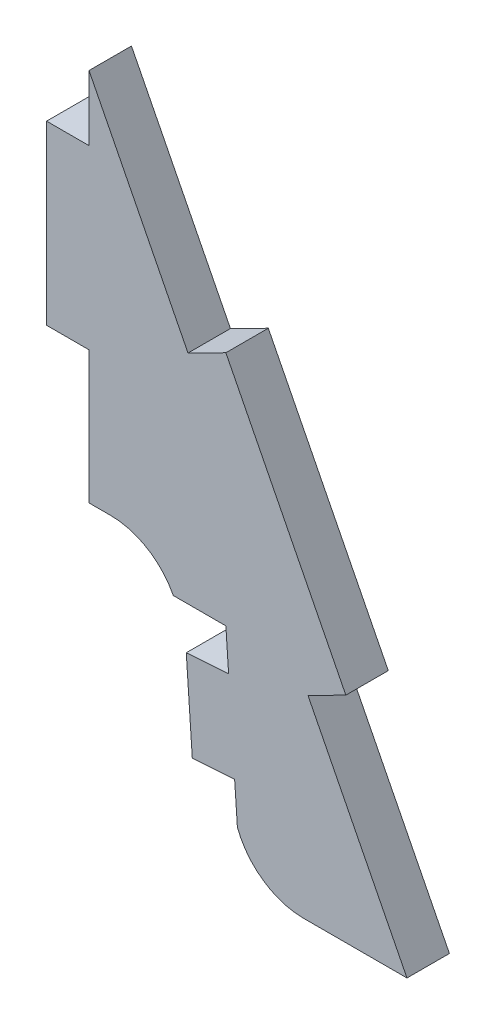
ISO-10303-21;
HEADER;
FILE_DESCRIPTION(('STEP AP214'),'2;1');
FILE_NAME('part.step','',(''),(''),'','','');
FILE_SCHEMA(('AUTOMOTIVE_DESIGN { 1 0 10303 214 1 1 1 1 }'));
ENDSEC;
DATA;
#1=APPLICATION_CONTEXT('core data for automotive mechanical design processes');
#2=APPLICATION_PROTOCOL_DEFINITION('international standard','automotive_design',2000,#1);
#3=PRODUCT_CONTEXT('',#1,'mechanical');
#4=PRODUCT('Part','Part','',(#3));
#5=PRODUCT_RELATED_PRODUCT_CATEGORY('part','',(#4));
#6=PRODUCT_DEFINITION_FORMATION('','',#4);
#7=PRODUCT_DEFINITION_CONTEXT('part definition',#1,'design');
#8=PRODUCT_DEFINITION('design','',#6,#7);
#9=PRODUCT_DEFINITION_SHAPE('','',#8);
#10=(LENGTH_UNIT() NAMED_UNIT(*) SI_UNIT(.MILLI.,.METRE.));
#11=(NAMED_UNIT(*) PLANE_ANGLE_UNIT() SI_UNIT($,.RADIAN.));
#12=(NAMED_UNIT(*) SI_UNIT($,.STERADIAN.) SOLID_ANGLE_UNIT());
#13=UNCERTAINTY_MEASURE_WITH_UNIT(LENGTH_MEASURE(1.E-05),#10,'distance_accuracy_value','');
#14=(GEOMETRIC_REPRESENTATION_CONTEXT(3) GLOBAL_UNCERTAINTY_ASSIGNED_CONTEXT((#13)) GLOBAL_UNIT_ASSIGNED_CONTEXT((#10,
#11,#12)) REPRESENTATION_CONTEXT('',''));
#15=CARTESIAN_POINT('',(0.,0.,0.));
#16=DIRECTION('',(0.,0.,1.));
#17=DIRECTION('',(1.,0.,0.));
#18=AXIS2_PLACEMENT_3D('',#15,#16,#17);
#19=CARTESIAN_POINT('',(1.52399999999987,-268.631646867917,1.524));
#20=DIRECTION('',(1.,0.,0.));
#21=DIRECTION('',(0.,1.,0.));
#22=AXIS2_PLACEMENT_3D('',#19,#20,#21);
#23=PLANE('',#22);
#24=DIRECTION('',(0.,-1.,0.));
#25=VECTOR('',#24,1.);
#26=CARTESIAN_POINT('',(1.52399999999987,-268.631646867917,0.));
#27=LINE('',#26,#25);
#28=CARTESIAN_POINT('',(1.52399999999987,-263.869146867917,0.));
#29=VERTEX_POINT('',#28);
#30=CARTESIAN_POINT('',(1.52399999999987,-268.631646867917,0.));
#31=VERTEX_POINT('',#30);
#32=EDGE_CURVE('E202',#29,#31,#27,.T.);
#33=ORIENTED_EDGE('',*,*,#32,.T.);
#34=DIRECTION('',(0.,0.,-1.));
#35=VECTOR('',#34,1.);
#36=CARTESIAN_POINT('',(1.52399999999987,-268.631646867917,1.524));
#37=LINE('',#36,#35);
#38=CARTESIAN_POINT('',(1.52399999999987,-268.631646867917,1.524));
#39=VERTEX_POINT('',#38);
#40=EDGE_CURVE('E11',#39,#31,#37,.T.);
#41=ORIENTED_EDGE('',*,*,#40,.F.);
#42=DIRECTION('',(0.,-1.,0.));
#43=VECTOR('',#42,1.);
#44=CARTESIAN_POINT('',(1.52399999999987,-268.631646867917,1.524));
#45=LINE('',#44,#43);
#46=CARTESIAN_POINT('',(1.52399999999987,-263.869146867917,1.524));
#47=VERTEX_POINT('',#46);
#48=EDGE_CURVE('E240',#47,#39,#45,.T.);
#49=ORIENTED_EDGE('',*,*,#48,.F.);
#50=DIRECTION('',(0.,0.,-1.));
#51=VECTOR('',#50,1.);
#52=CARTESIAN_POINT('',(1.52399999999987,-263.869146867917,1.524));
#53=LINE('',#52,#51);
#54=EDGE_CURVE('E198',#47,#29,#53,.T.);
#55=ORIENTED_EDGE('',*,*,#54,.T.);
#56=EDGE_LOOP('',(#33,#41,#49,#55));
#57=FACE_BOUND('',#56,.T.);
#58=ADVANCED_FACE('F34',(#57),#23,.F.);
#59=CARTESIAN_POINT('',(1.52399999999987,-268.631646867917,1.524));
#60=DIRECTION('',(0.,1.,0.));
#61=DIRECTION('',(0.,0.,1.));
#62=AXIS2_PLACEMENT_3D('',#59,#60,#61);
#63=PLANE('',#62);
#64=DIRECTION('',(1.,0.,0.));
#65=VECTOR('',#64,1.);
#66=CARTESIAN_POINT('',(1.52399999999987,-268.631646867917,0.));
#67=LINE('',#66,#65);
#68=CARTESIAN_POINT('',(2.30035756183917,-268.631646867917,0.));
#69=VERTEX_POINT('',#68);
#70=EDGE_CURVE('E205',#31,#69,#67,.T.);
#71=ORIENTED_EDGE('',*,*,#70,.T.);
#72=DIRECTION('',(0.,0.,-1.));
#73=VECTOR('',#72,1.);
#74=CARTESIAN_POINT('',(2.30035756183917,-268.631646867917,1.524));
#75=LINE('',#74,#73);
#76=CARTESIAN_POINT('',(2.30035756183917,-268.631646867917,1.524));
#77=VERTEX_POINT('',#76);
#78=EDGE_CURVE('E42',#77,#69,#75,.T.);
#79=ORIENTED_EDGE('',*,*,#78,.F.);
#80=DIRECTION('',(1.,0.,0.));
#81=VECTOR('',#80,1.);
#82=CARTESIAN_POINT('',(1.52399999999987,-268.631646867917,1.524));
#83=LINE('',#82,#81);
#84=EDGE_CURVE('E129',#39,#77,#83,.T.);
#85=ORIENTED_EDGE('',*,*,#84,.F.);
#86=ORIENTED_EDGE('',*,*,#40,.T.);
#87=EDGE_LOOP('',(#71,#79,#85,#86));
#88=FACE_BOUND('',#87,.T.);
#89=ADVANCED_FACE('F358',(#88),#63,.F.);
#90=CARTESIAN_POINT('',(2.30035756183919,-271.171646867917,1.524));
#91=DIRECTION('',(0.,0.,-1.));
#92=DIRECTION('',(-1.,0.,0.));
#93=AXIS2_PLACEMENT_3D('',#90,#91,#92);
#94=CYLINDRICAL_SURFACE('',#93,2.53999999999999);
#95=CARTESIAN_POINT('',(2.30035756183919,-271.171646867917,0.));
#96=DIRECTION('',(0.,0.,-1.));
#97=DIRECTION('',(-1.,0.,0.));
#98=AXIS2_PLACEMENT_3D('',#95,#96,#97);
#99=CIRCLE('',#98,2.53999999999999);
#100=CARTESIAN_POINT('',(4.55272917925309,-269.997584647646,0.));
#101=VERTEX_POINT('',#100);
#102=EDGE_CURVE('E207',#69,#101,#99,.T.);
#103=ORIENTED_EDGE('',*,*,#102,.T.);
#104=DIRECTION('',(0.,0.,-1.));
#105=VECTOR('',#104,1.);
#106=CARTESIAN_POINT('',(4.55272917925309,-269.997584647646,1.524));
#107=LINE('',#106,#105);
#108=CARTESIAN_POINT('',(4.55272917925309,-269.997584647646,1.524));
#109=VERTEX_POINT('',#108);
#110=EDGE_CURVE('E283',#109,#101,#107,.T.);
#111=ORIENTED_EDGE('',*,*,#110,.F.);
#112=CARTESIAN_POINT('',(2.30035756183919,-271.171646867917,1.524));
#113=DIRECTION('',(0.,0.,-1.));
#114=DIRECTION('',(-1.,0.,0.));
#115=AXIS2_PLACEMENT_3D('',#112,#113,#114);
#116=CIRCLE('',#115,2.53999999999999);
#117=EDGE_CURVE('E291',#77,#109,#116,.T.);
#118=ORIENTED_EDGE('',*,*,#117,.F.);
#119=ORIENTED_EDGE('',*,*,#78,.T.);
#120=EDGE_LOOP('',(#103,#111,#118,#119));
#121=FACE_BOUND('',#120,.T.);
#122=ADVANCED_FACE('F289',(#121),#94,.F.);
#123=CARTESIAN_POINT('',(6.43810884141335,-269.997584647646,1.524));
#124=DIRECTION('',(0.,1.,0.));
#125=DIRECTION('',(0.,0.,1.));
#126=AXIS2_PLACEMENT_3D('',#123,#124,#125);
#127=PLANE('',#126);
#128=DIRECTION('',(1.,0.,0.));
#129=VECTOR('',#128,1.);
#130=CARTESIAN_POINT('',(6.43810884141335,-269.997584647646,0.));
#131=LINE('',#130,#129);
#132=CARTESIAN_POINT('',(6.43810884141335,-269.997584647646,0.));
#133=VERTEX_POINT('',#132);
#134=EDGE_CURVE('E209',#101,#133,#131,.T.);
#135=ORIENTED_EDGE('',*,*,#134,.T.);
#136=DIRECTION('',(0.,0.,-1.));
#137=VECTOR('',#136,1.);
#138=CARTESIAN_POINT('',(6.43810884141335,-269.997584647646,1.524));
#139=LINE('',#138,#137);
#140=CARTESIAN_POINT('',(6.43810884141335,-269.997584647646,1.524));
#141=VERTEX_POINT('',#140);
#142=EDGE_CURVE('E280',#141,#133,#139,.T.);
#143=ORIENTED_EDGE('',*,*,#142,.F.);
#144=DIRECTION('',(1.,0.,0.));
#145=VECTOR('',#144,1.);
#146=CARTESIAN_POINT('',(6.43810884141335,-269.997584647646,1.524));
#147=LINE('',#146,#145);
#148=EDGE_CURVE('E309',#109,#141,#147,.T.);
#149=ORIENTED_EDGE('',*,*,#148,.F.);
#150=ORIENTED_EDGE('',*,*,#110,.T.);
#151=EDGE_LOOP('',(#135,#143,#149,#150));
#152=FACE_BOUND('',#151,.T.);
#153=ADVANCED_FACE('F300',(#152),#127,.F.);
#154=CARTESIAN_POINT('',(6.53667673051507,-271.440608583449,1.524));
#155=DIRECTION('',(0.997675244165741,0.0681476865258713,0.));
#156=DIRECTION('',(-0.0681476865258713,0.997675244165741,0.));
#157=AXIS2_PLACEMENT_3D('',#154,#155,#156);
#158=PLANE('',#157);
#159=DIRECTION('',(0.0681476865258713,-0.997675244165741,0.));
#160=VECTOR('',#159,1.);
#161=CARTESIAN_POINT('',(6.53667673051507,-271.440608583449,0.));
#162=LINE('',#161,#160);
#163=CARTESIAN_POINT('',(6.53667673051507,-271.440608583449,0.));
#164=VERTEX_POINT('',#163);
#165=EDGE_CURVE('E211',#133,#164,#162,.T.);
#166=ORIENTED_EDGE('',*,*,#165,.T.);
#167=DIRECTION('',(0.,0.,-1.));
#168=VECTOR('',#167,1.);
#169=CARTESIAN_POINT('',(6.53667673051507,-271.440608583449,1.524));
#170=LINE('',#169,#168);
#171=CARTESIAN_POINT('',(6.53667673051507,-271.440608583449,1.524));
#172=VERTEX_POINT('',#171);
#173=EDGE_CURVE('E277',#172,#164,#170,.T.);
#174=ORIENTED_EDGE('',*,*,#173,.F.);
#175=DIRECTION('',(0.0681476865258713,-0.997675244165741,0.));
#176=VECTOR('',#175,1.);
#177=CARTESIAN_POINT('',(6.53667673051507,-271.440608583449,1.524));
#178=LINE('',#177,#176);
#179=EDGE_CURVE('E306',#141,#172,#178,.T.);
#180=ORIENTED_EDGE('',*,*,#179,.F.);
#181=ORIENTED_EDGE('',*,*,#142,.T.);
#182=EDGE_LOOP('',(#166,#174,#180,#181));
#183=FACE_BOUND('',#182,.T.);
#184=ADVANCED_FACE('F304',(#183),#158,.F.);
#185=CARTESIAN_POINT('',(6.53667673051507,-271.440608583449,1.524));
#186=DIRECTION('',(0.068147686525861,-0.997675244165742,0.));
#187=DIRECTION('',(0.997675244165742,0.068147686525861,0.));
#188=AXIS2_PLACEMENT_3D('',#185,#186,#187);
#189=PLANE('',#188);
#190=DIRECTION('',(-0.997675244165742,-0.068147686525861,0.));
#191=VECTOR('',#190,1.);
#192=CARTESIAN_POINT('',(6.53667673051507,-271.440608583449,0.));
#193=LINE('',#192,#191);
#194=CARTESIAN_POINT('',(5.01621965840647,-271.544465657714,0.));
#195=VERTEX_POINT('',#194);
#196=EDGE_CURVE('E213',#164,#195,#193,.T.);
#197=ORIENTED_EDGE('',*,*,#196,.T.);
#198=DIRECTION('',(0.,0.,-1.));
#199=VECTOR('',#198,1.);
#200=CARTESIAN_POINT('',(5.01621965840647,-271.544465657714,1.524));
#201=LINE('',#200,#199);
#202=CARTESIAN_POINT('',(5.01621965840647,-271.544465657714,1.524));
#203=VERTEX_POINT('',#202);
#204=EDGE_CURVE('E274',#203,#195,#201,.T.);
#205=ORIENTED_EDGE('',*,*,#204,.F.);
#206=DIRECTION('',(-0.997675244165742,-0.068147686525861,0.));
#207=VECTOR('',#206,1.);
#208=CARTESIAN_POINT('',(6.53667673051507,-271.440608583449,1.524));
#209=LINE('',#208,#207);
#210=EDGE_CURVE('E308',#172,#203,#209,.T.);
#211=ORIENTED_EDGE('',*,*,#210,.F.);
#212=ORIENTED_EDGE('',*,*,#173,.T.);
#213=EDGE_LOOP('',(#197,#205,#211,#212));
#214=FACE_BOUND('',#213,.T.);
#215=ADVANCED_FACE('F371',(#214),#189,.F.);
#216=CARTESIAN_POINT('',(5.01621965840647,-271.544465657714,1.524));
#217=DIRECTION('',(0.997675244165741,0.0681476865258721,0.));
#218=DIRECTION('',(-0.0681476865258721,0.997675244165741,0.));
#219=AXIS2_PLACEMENT_3D('',#216,#217,#218);
#220=PLANE('',#219);
#221=DIRECTION('',(0.0681476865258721,-0.997675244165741,0.));
#222=VECTOR('',#221,1.);
#223=CARTESIAN_POINT('',(5.01621965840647,-271.544465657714,0.));
#224=LINE('',#223,#222);
#225=CARTESIAN_POINT('',(5.23258856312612,-274.71208455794,0.));
#226=VERTEX_POINT('',#225);
#227=EDGE_CURVE('E215',#195,#226,#224,.T.);
#228=ORIENTED_EDGE('',*,*,#227,.T.);
#229=DIRECTION('',(0.,0.,-1.));
#230=VECTOR('',#229,1.);
#231=CARTESIAN_POINT('',(5.23258856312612,-274.71208455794,1.524));
#232=LINE('',#231,#230);
#233=CARTESIAN_POINT('',(5.23258856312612,-274.71208455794,1.524));
#234=VERTEX_POINT('',#233);
#235=EDGE_CURVE('E271',#234,#226,#232,.T.);
#236=ORIENTED_EDGE('',*,*,#235,.F.);
#237=DIRECTION('',(0.0681476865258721,-0.997675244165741,0.));
#238=VECTOR('',#237,1.);
#239=CARTESIAN_POINT('',(5.01621965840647,-271.544465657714,1.524));
#240=LINE('',#239,#238);
#241=EDGE_CURVE('E311',#203,#234,#240,.T.);
#242=ORIENTED_EDGE('',*,*,#241,.F.);
#243=ORIENTED_EDGE('',*,*,#204,.T.);
#244=EDGE_LOOP('',(#228,#236,#242,#243));
#245=FACE_BOUND('',#244,.T.);
#246=ADVANCED_FACE('F374',(#245),#220,.F.);
#247=CARTESIAN_POINT('',(6.75304563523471,-274.608227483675,1.524));
#248=DIRECTION('',(-0.068147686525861,0.997675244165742,0.));
#249=DIRECTION('',(-0.997675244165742,-0.068147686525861,0.));
#250=AXIS2_PLACEMENT_3D('',#247,#248,#249);
#251=PLANE('',#250);
#252=DIRECTION('',(0.997675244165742,0.068147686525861,0.));
#253=VECTOR('',#252,1.);
#254=CARTESIAN_POINT('',(6.75304563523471,-274.608227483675,0.));
#255=LINE('',#254,#253);
#256=CARTESIAN_POINT('',(6.75304563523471,-274.608227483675,0.));
#257=VERTEX_POINT('',#256);
#258=EDGE_CURVE('E217',#226,#257,#255,.T.);
#259=ORIENTED_EDGE('',*,*,#258,.T.);
#260=DIRECTION('',(0.,0.,-1.));
#261=VECTOR('',#260,1.);
#262=CARTESIAN_POINT('',(6.75304563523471,-274.608227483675,1.524));
#263=LINE('',#262,#261);
#264=CARTESIAN_POINT('',(6.75304563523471,-274.608227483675,1.524));
#265=VERTEX_POINT('',#264);
#266=EDGE_CURVE('E268',#265,#257,#263,.T.);
#267=ORIENTED_EDGE('',*,*,#266,.F.);
#268=DIRECTION('',(0.997675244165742,0.068147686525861,0.));
#269=VECTOR('',#268,1.);
#270=CARTESIAN_POINT('',(6.75304563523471,-274.608227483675,1.524));
#271=LINE('',#270,#269);
#272=EDGE_CURVE('E317',#234,#265,#271,.T.);
#273=ORIENTED_EDGE('',*,*,#272,.F.);
#274=ORIENTED_EDGE('',*,*,#235,.T.);
#275=EDGE_LOOP('',(#259,#267,#273,#274));
#276=FACE_BOUND('',#275,.T.);
#277=ADVANCED_FACE('F378',(#276),#251,.F.);
#278=CARTESIAN_POINT('',(6.85161352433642,-276.051251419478,1.524));
#279=DIRECTION('',(0.997675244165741,0.0681476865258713,0.));
#280=DIRECTION('',(-0.0681476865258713,0.997675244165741,0.));
#281=AXIS2_PLACEMENT_3D('',#278,#279,#280);
#282=PLANE('',#281);
#283=DIRECTION('',(0.0681476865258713,-0.997675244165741,0.));
#284=VECTOR('',#283,1.);
#285=CARTESIAN_POINT('',(6.85161352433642,-276.051251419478,0.));
#286=LINE('',#285,#284);
#287=CARTESIAN_POINT('',(6.85161352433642,-276.051251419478,0.));
#288=VERTEX_POINT('',#287);
#289=EDGE_CURVE('E219',#257,#288,#286,.T.);
#290=ORIENTED_EDGE('',*,*,#289,.T.);
#291=DIRECTION('',(0.,0.,-1.));
#292=VECTOR('',#291,1.);
#293=CARTESIAN_POINT('',(6.85161352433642,-276.051251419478,1.524));
#294=LINE('',#293,#292);
#295=CARTESIAN_POINT('',(6.85161352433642,-276.051251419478,1.524));
#296=VERTEX_POINT('',#295);
#297=EDGE_CURVE('E265',#296,#288,#294,.T.);
#298=ORIENTED_EDGE('',*,*,#297,.F.);
#299=DIRECTION('',(0.0681476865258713,-0.997675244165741,0.));
#300=VECTOR('',#299,1.);
#301=CARTESIAN_POINT('',(6.85161352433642,-276.051251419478,1.524));
#302=LINE('',#301,#300);
#303=EDGE_CURVE('E319',#265,#296,#302,.T.);
#304=ORIENTED_EDGE('',*,*,#303,.F.);
#305=ORIENTED_EDGE('',*,*,#266,.T.);
#306=EDGE_LOOP('',(#290,#298,#304,#305));
#307=FACE_BOUND('',#306,.T.);
#308=ADVANCED_FACE('F382',(#307),#282,.F.);
#309=CARTESIAN_POINT('',(9.22871211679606,-275.156264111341,1.524));
#310=DIRECTION('',(0.,0.,-1.));
#311=DIRECTION('',(-1.,0.,0.));
#312=AXIS2_PLACEMENT_3D('',#309,#310,#311);
#313=CYLINDRICAL_SURFACE('',#312,2.53999999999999);
#314=CARTESIAN_POINT('',(9.22871211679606,-275.156264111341,0.));
#315=DIRECTION('',(0.,0.,1.));
#316=DIRECTION('',(1.,0.,0.));
#317=AXIS2_PLACEMENT_3D('',#314,#315,#316);
#318=CIRCLE('',#317,2.53999999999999);
#319=CARTESIAN_POINT('',(9.22871211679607,-277.696264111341,0.));
#320=VERTEX_POINT('',#319);
#321=EDGE_CURVE('E221',#288,#320,#318,.T.);
#322=ORIENTED_EDGE('',*,*,#321,.T.);
#323=DIRECTION('',(0.,0.,-1.));
#324=VECTOR('',#323,1.);
#325=CARTESIAN_POINT('',(9.22871211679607,-277.696264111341,1.524));
#326=LINE('',#325,#324);
#327=CARTESIAN_POINT('',(9.22871211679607,-277.696264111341,1.524));
#328=VERTEX_POINT('',#327);
#329=EDGE_CURVE('E262',#328,#320,#326,.T.);
#330=ORIENTED_EDGE('',*,*,#329,.F.);
#331=CARTESIAN_POINT('',(9.22871211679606,-275.156264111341,1.524));
#332=DIRECTION('',(0.,0.,1.));
#333=DIRECTION('',(1.,0.,0.));
#334=AXIS2_PLACEMENT_3D('',#331,#332,#333);
#335=CIRCLE('',#334,2.53999999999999);
#336=EDGE_CURVE('E321',#296,#328,#335,.T.);
#337=ORIENTED_EDGE('',*,*,#336,.F.);
#338=ORIENTED_EDGE('',*,*,#297,.T.);
#339=EDGE_LOOP('',(#322,#330,#337,#338));
#340=FACE_BOUND('',#339,.T.);
#341=ADVANCED_FACE('F386',(#340),#313,.T.);
#342=CARTESIAN_POINT('',(12.9422043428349,-277.696264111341,1.524));
#343=DIRECTION('',(0.,1.,0.));
#344=DIRECTION('',(0.,0.,1.));
#345=AXIS2_PLACEMENT_3D('',#342,#343,#344);
#346=PLANE('',#345);
#347=DIRECTION('',(1.,0.,0.));
#348=VECTOR('',#347,1.);
#349=CARTESIAN_POINT('',(12.9422043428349,-277.696264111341,0.));
#350=LINE('',#349,#348);
#351=CARTESIAN_POINT('',(12.9422043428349,-277.696264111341,0.));
#352=VERTEX_POINT('',#351);
#353=EDGE_CURVE('E223',#320,#352,#350,.T.);
#354=ORIENTED_EDGE('',*,*,#353,.T.);
#355=DIRECTION('',(0.,0.,-1.));
#356=VECTOR('',#355,1.);
#357=CARTESIAN_POINT('',(12.9422043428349,-277.696264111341,1.524));
#358=LINE('',#357,#356);
#359=CARTESIAN_POINT('',(12.9422043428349,-277.696264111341,1.524));
#360=VERTEX_POINT('',#359);
#361=EDGE_CURVE('E259',#360,#352,#358,.T.);
#362=ORIENTED_EDGE('',*,*,#361,.F.);
#363=DIRECTION('',(1.,0.,0.));
#364=VECTOR('',#363,1.);
#365=CARTESIAN_POINT('',(12.9422043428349,-277.696264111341,1.524));
#366=LINE('',#365,#364);
#367=EDGE_CURVE('E323',#328,#360,#366,.T.);
#368=ORIENTED_EDGE('',*,*,#367,.F.);
#369=ORIENTED_EDGE('',*,*,#329,.T.);
#370=EDGE_LOOP('',(#354,#362,#368,#369));
#371=FACE_BOUND('',#370,.T.);
#372=ADVANCED_FACE('F390',(#371),#346,.F.);
#373=CARTESIAN_POINT('',(9.3872825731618,-270.686922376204,1.524));
#374=DIRECTION('',(-0.891855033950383,-0.452321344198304,0.));
#375=DIRECTION('',(0.452321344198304,-0.891855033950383,0.));
#376=AXIS2_PLACEMENT_3D('',#373,#374,#375);
#377=PLANE('',#376);
#378=DIRECTION('',(-0.452321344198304,0.891855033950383,0.));
#379=VECTOR('',#378,1.);
#380=CARTESIAN_POINT('',(9.3872825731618,-270.686922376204,0.));
#381=LINE('',#380,#379);
#382=CARTESIAN_POINT('',(9.3872825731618,-270.686922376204,0.));
#383=VERTEX_POINT('',#382);
#384=EDGE_CURVE('E225',#352,#383,#381,.T.);
#385=ORIENTED_EDGE('',*,*,#384,.T.);
#386=DIRECTION('',(0.,0.,-1.));
#387=VECTOR('',#386,1.);
#388=CARTESIAN_POINT('',(9.3872825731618,-270.686922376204,1.524));
#389=LINE('',#388,#387);
#390=CARTESIAN_POINT('',(9.3872825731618,-270.686922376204,1.524));
#391=VERTEX_POINT('',#390);
#392=EDGE_CURVE('E256',#391,#383,#389,.T.);
#393=ORIENTED_EDGE('',*,*,#392,.F.);
#394=DIRECTION('',(-0.452321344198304,0.891855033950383,0.));
#395=VECTOR('',#394,1.);
#396=CARTESIAN_POINT('',(9.3872825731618,-270.686922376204,1.524));
#397=LINE('',#396,#395);
#398=EDGE_CURVE('E325',#360,#391,#397,.T.);
#399=ORIENTED_EDGE('',*,*,#398,.F.);
#400=ORIENTED_EDGE('',*,*,#361,.T.);
#401=EDGE_LOOP('',(#385,#393,#399,#400));
#402=FACE_BOUND('',#401,.T.);
#403=ADVANCED_FACE('F394',(#402),#377,.F.);
#404=CARTESIAN_POINT('',(9.3872825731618,-270.686922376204,1.524));
#405=DIRECTION('',(-0.452321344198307,0.891855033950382,0.));
#406=DIRECTION('',(-0.891855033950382,-0.452321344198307,0.));
#407=AXIS2_PLACEMENT_3D('',#404,#405,#406);
#408=PLANE('',#407);
#409=DIRECTION('',(0.891855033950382,0.452321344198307,0.));
#410=VECTOR('',#409,1.);
#411=CARTESIAN_POINT('',(9.3872825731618,-270.686922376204,0.));
#412=LINE('',#411,#410);
#413=CARTESIAN_POINT('',(10.7464696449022,-269.997584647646,0.));
#414=VERTEX_POINT('',#413);
#415=EDGE_CURVE('E227',#383,#414,#412,.T.);
#416=ORIENTED_EDGE('',*,*,#415,.T.);
#417=DIRECTION('',(0.,0.,-1.));
#418=VECTOR('',#417,1.);
#419=CARTESIAN_POINT('',(10.7464696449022,-269.997584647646,1.524));
#420=LINE('',#419,#418);
#421=CARTESIAN_POINT('',(10.7464696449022,-269.997584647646,1.524));
#422=VERTEX_POINT('',#421);
#423=EDGE_CURVE('E253',#422,#414,#420,.T.);
#424=ORIENTED_EDGE('',*,*,#423,.F.);
#425=DIRECTION('',(0.891855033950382,0.452321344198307,0.));
#426=VECTOR('',#425,1.);
#427=CARTESIAN_POINT('',(9.3872825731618,-270.686922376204,1.524));
#428=LINE('',#427,#426);
#429=EDGE_CURVE('E327',#391,#422,#428,.T.);
#430=ORIENTED_EDGE('',*,*,#429,.F.);
#431=ORIENTED_EDGE('',*,*,#392,.T.);
#432=EDGE_LOOP('',(#416,#424,#430,#431));
#433=FACE_BOUND('',#432,.T.);
#434=ADVANCED_FACE('F398',(#433),#408,.F.);
#435=CARTESIAN_POINT('',(10.7464696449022,-269.997584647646,1.524));
#436=DIRECTION('',(-0.891855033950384,-0.452321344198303,0.));
#437=DIRECTION('',(0.452321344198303,-0.891855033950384,0.));
#438=AXIS2_PLACEMENT_3D('',#435,#436,#437);
#439=PLANE('',#438);
#440=DIRECTION('',(-0.452321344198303,0.891855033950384,0.));
#441=VECTOR('',#440,1.);
#442=CARTESIAN_POINT('',(10.7464696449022,-269.997584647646,0.));
#443=LINE('',#442,#441);
#444=CARTESIAN_POINT('',(6.43810884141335,-261.502665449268,0.));
#445=VERTEX_POINT('',#444);
#446=EDGE_CURVE('E229',#414,#445,#443,.T.);
#447=ORIENTED_EDGE('',*,*,#446,.T.);
#448=DIRECTION('',(0.,0.,-1.));
#449=VECTOR('',#448,1.);
#450=CARTESIAN_POINT('',(6.43810884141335,-261.502665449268,1.524));
#451=LINE('',#450,#449);
#452=CARTESIAN_POINT('',(6.43810884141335,-261.502665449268,1.524));
#453=VERTEX_POINT('',#452);
#454=EDGE_CURVE('E250',#453,#445,#451,.T.);
#455=ORIENTED_EDGE('',*,*,#454,.F.);
#456=DIRECTION('',(-0.452321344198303,0.891855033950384,0.));
#457=VECTOR('',#456,1.);
#458=CARTESIAN_POINT('',(10.7464696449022,-269.997584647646,1.524));
#459=LINE('',#458,#457);
#460=EDGE_CURVE('E329',#422,#453,#459,.T.);
#461=ORIENTED_EDGE('',*,*,#460,.F.);
#462=ORIENTED_EDGE('',*,*,#423,.T.);
#463=EDGE_LOOP('',(#447,#455,#461,#462));
#464=FACE_BOUND('',#463,.T.);
#465=ADVANCED_FACE('F402',(#464),#439,.F.);
#466=CARTESIAN_POINT('',(5.07892176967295,-262.192003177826,1.524));
#467=DIRECTION('',(0.452321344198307,-0.891855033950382,0.));
#468=DIRECTION('',(0.891855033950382,0.452321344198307,0.));
#469=AXIS2_PLACEMENT_3D('',#466,#467,#468);
#470=PLANE('',#469);
#471=DIRECTION('',(-0.891855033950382,-0.452321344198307,0.));
#472=VECTOR('',#471,1.);
#473=CARTESIAN_POINT('',(5.07892176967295,-262.192003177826,0.));
#474=LINE('',#473,#472);
#475=CARTESIAN_POINT('',(5.07892176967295,-262.192003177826,0.));
#476=VERTEX_POINT('',#475);
#477=EDGE_CURVE('E231',#445,#476,#474,.T.);
#478=ORIENTED_EDGE('',*,*,#477,.T.);
#479=DIRECTION('',(0.,0.,-1.));
#480=VECTOR('',#479,1.);
#481=CARTESIAN_POINT('',(5.07892176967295,-262.192003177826,1.524));
#482=LINE('',#481,#480);
#483=CARTESIAN_POINT('',(5.07892176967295,-262.192003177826,1.524));
#484=VERTEX_POINT('',#483);
#485=EDGE_CURVE('E247',#484,#476,#482,.T.);
#486=ORIENTED_EDGE('',*,*,#485,.F.);
#487=DIRECTION('',(-0.891855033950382,-0.452321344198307,0.));
#488=VECTOR('',#487,1.);
#489=CARTESIAN_POINT('',(5.07892176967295,-262.192003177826,1.524));
#490=LINE('',#489,#488);
#491=EDGE_CURVE('E331',#453,#484,#490,.T.);
#492=ORIENTED_EDGE('',*,*,#491,.F.);
#493=ORIENTED_EDGE('',*,*,#454,.T.);
#494=EDGE_LOOP('',(#478,#486,#492,#493));
#495=FACE_BOUND('',#494,.T.);
#496=ADVANCED_FACE('F406',(#495),#470,.F.);
#497=CARTESIAN_POINT('',(1.52399999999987,-255.182661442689,1.524));
#498=DIRECTION('',(-0.891855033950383,-0.452321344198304,0.));
#499=DIRECTION('',(0.452321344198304,-0.891855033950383,0.));
#500=AXIS2_PLACEMENT_3D('',#497,#498,#499);
#501=PLANE('',#500);
#502=DIRECTION('',(-0.452321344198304,0.891855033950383,0.));
#503=VECTOR('',#502,1.);
#504=CARTESIAN_POINT('',(1.52399999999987,-255.182661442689,0.));
#505=LINE('',#504,#503);
#506=CARTESIAN_POINT('',(1.52399999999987,-255.182661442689,0.));
#507=VERTEX_POINT('',#506);
#508=EDGE_CURVE('E233',#476,#507,#505,.T.);
#509=ORIENTED_EDGE('',*,*,#508,.T.);
#510=DIRECTION('',(0.,0.,-1.));
#511=VECTOR('',#510,1.);
#512=CARTESIAN_POINT('',(1.52399999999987,-255.182661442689,1.524));
#513=LINE('',#512,#511);
#514=CARTESIAN_POINT('',(1.52399999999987,-255.182661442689,1.524));
#515=VERTEX_POINT('',#514);
#516=EDGE_CURVE('E244',#515,#507,#513,.T.);
#517=ORIENTED_EDGE('',*,*,#516,.F.);
#518=DIRECTION('',(-0.452321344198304,0.891855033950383,0.));
#519=VECTOR('',#518,1.);
#520=CARTESIAN_POINT('',(1.52399999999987,-255.182661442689,1.524));
#521=LINE('',#520,#519);
#522=EDGE_CURVE('E333',#484,#515,#521,.T.);
#523=ORIENTED_EDGE('',*,*,#522,.F.);
#524=ORIENTED_EDGE('',*,*,#485,.T.);
#525=EDGE_LOOP('',(#509,#517,#523,#524));
#526=FACE_BOUND('',#525,.T.);
#527=ADVANCED_FACE('F339',(#526),#501,.F.);
#528=CARTESIAN_POINT('',(1.52399999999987,-257.519146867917,1.524));
#529=DIRECTION('',(1.,0.,0.));
#530=DIRECTION('',(0.,0.,-1.));
#531=AXIS2_PLACEMENT_3D('',#528,#529,#530);
#532=PLANE('',#531);
#533=DIRECTION('',(0.,-1.,0.));
#534=VECTOR('',#533,1.);
#535=CARTESIAN_POINT('',(1.52399999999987,-257.519146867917,0.));
#536=LINE('',#535,#534);
#537=CARTESIAN_POINT('',(1.52399999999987,-257.519146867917,0.));
#538=VERTEX_POINT('',#537);
#539=EDGE_CURVE('E235',#507,#538,#536,.T.);
#540=ORIENTED_EDGE('',*,*,#539,.T.);
#541=DIRECTION('',(0.,0.,-1.));
#542=VECTOR('',#541,1.);
#543=CARTESIAN_POINT('',(1.52399999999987,-257.519146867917,1.524));
#544=LINE('',#543,#542);
#545=CARTESIAN_POINT('',(1.52399999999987,-257.519146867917,1.524));
#546=VERTEX_POINT('',#545);
#547=EDGE_CURVE('E193',#546,#538,#544,.T.);
#548=ORIENTED_EDGE('',*,*,#547,.F.);
#549=DIRECTION('',(0.,-1.,0.));
#550=VECTOR('',#549,1.);
#551=CARTESIAN_POINT('',(1.52399999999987,-257.519146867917,1.524));
#552=LINE('',#551,#550);
#553=EDGE_CURVE('E184',#515,#546,#552,.T.);
#554=ORIENTED_EDGE('',*,*,#553,.F.);
#555=ORIENTED_EDGE('',*,*,#516,.T.);
#556=EDGE_LOOP('',(#540,#548,#554,#555));
#557=FACE_BOUND('',#556,.T.);
#558=ADVANCED_FACE('F343',(#557),#532,.F.);
#559=CARTESIAN_POINT('',(-1.31165955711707E-13,-257.519146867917,1.524));
#560=DIRECTION('',(0.,-1.,0.));
#561=DIRECTION('',(0.,0.,-1.));
#562=AXIS2_PLACEMENT_3D('',#559,#560,#561);
#563=PLANE('',#562);
#564=DIRECTION('',(-1.,0.,0.));
#565=VECTOR('',#564,1.);
#566=CARTESIAN_POINT('',(-1.31165955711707E-13,-257.519146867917,0.));
#567=LINE('',#566,#565);
#568=CARTESIAN_POINT('',(-1.31165955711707E-13,-257.519146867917,0.));
#569=VERTEX_POINT('',#568);
#570=EDGE_CURVE('E192',#538,#569,#567,.T.);
#571=ORIENTED_EDGE('',*,*,#570,.T.);
#572=DIRECTION('',(0.,0.,-1.));
#573=VECTOR('',#572,1.);
#574=CARTESIAN_POINT('',(-1.31165955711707E-13,-257.519146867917,1.524));
#575=LINE('',#574,#573);
#576=CARTESIAN_POINT('',(-1.31165955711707E-13,-257.519146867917,1.524));
#577=VERTEX_POINT('',#576);
#578=EDGE_CURVE('E189',#577,#569,#575,.T.);
#579=ORIENTED_EDGE('',*,*,#578,.F.);
#580=DIRECTION('',(-1.,0.,0.));
#581=VECTOR('',#580,1.);
#582=CARTESIAN_POINT('',(-1.31165955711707E-13,-257.519146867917,1.524));
#583=LINE('',#582,#581);
#584=EDGE_CURVE('E178',#546,#577,#583,.T.);
#585=ORIENTED_EDGE('',*,*,#584,.F.);
#586=ORIENTED_EDGE('',*,*,#547,.T.);
#587=EDGE_LOOP('',(#571,#579,#585,#586));
#588=FACE_BOUND('',#587,.T.);
#589=ADVANCED_FACE('F190',(#588),#563,.F.);
#590=CARTESIAN_POINT('',(-1.34400293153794E-13,-263.869146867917,1.524));
#591=DIRECTION('',(1.,0.,0.));
#592=DIRECTION('',(0.,1.,0.));
#593=AXIS2_PLACEMENT_3D('',#590,#591,#592);
#594=PLANE('',#593);
#595=DIRECTION('',(0.,-1.,0.));
#596=VECTOR('',#595,1.);
#597=CARTESIAN_POINT('',(-1.34400293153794E-13,-263.869146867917,0.));
#598=LINE('',#597,#596);
#599=CARTESIAN_POINT('',(-1.34400293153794E-13,-263.869146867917,0.));
#600=VERTEX_POINT('',#599);
#601=EDGE_CURVE('E115',#569,#600,#598,.T.);
#602=ORIENTED_EDGE('',*,*,#601,.T.);
#603=DIRECTION('',(0.,0.,-1.));
#604=VECTOR('',#603,1.);
#605=CARTESIAN_POINT('',(-1.34400293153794E-13,-263.869146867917,1.524));
#606=LINE('',#605,#604);
#607=CARTESIAN_POINT('',(-1.34400293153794E-13,-263.869146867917,1.524));
#608=VERTEX_POINT('',#607);
#609=EDGE_CURVE('E194',#608,#600,#606,.T.);
#610=ORIENTED_EDGE('',*,*,#609,.F.);
#611=DIRECTION('',(0.,-1.,0.));
#612=VECTOR('',#611,1.);
#613=CARTESIAN_POINT('',(-1.34400293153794E-13,-263.869146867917,1.524));
#614=LINE('',#613,#612);
#615=EDGE_CURVE('E182',#577,#608,#614,.T.);
#616=ORIENTED_EDGE('',*,*,#615,.F.);
#617=ORIENTED_EDGE('',*,*,#578,.T.);
#618=EDGE_LOOP('',(#602,#610,#616,#617));
#619=FACE_BOUND('',#618,.T.);
#620=ADVANCED_FACE('F196',(#619),#594,.F.);
#621=CARTESIAN_POINT('',(1.52399999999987,-263.869146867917,1.524));
#622=DIRECTION('',(0.,1.,0.));
#623=DIRECTION('',(0.,0.,1.));
#624=AXIS2_PLACEMENT_3D('',#621,#622,#623);
#625=PLANE('',#624);
#626=DIRECTION('',(1.,0.,0.));
#627=VECTOR('',#626,1.);
#628=CARTESIAN_POINT('',(1.52399999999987,-263.869146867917,0.));
#629=LINE('',#628,#627);
#630=EDGE_CURVE('E121',#600,#29,#629,.T.);
#631=ORIENTED_EDGE('',*,*,#630,.T.);
#632=ORIENTED_EDGE('',*,*,#54,.F.);
#633=DIRECTION('',(1.,0.,0.));
#634=VECTOR('',#633,1.);
#635=CARTESIAN_POINT('',(1.52399999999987,-263.869146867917,1.524));
#636=LINE('',#635,#634);
#637=EDGE_CURVE('E50',#608,#47,#636,.T.);
#638=ORIENTED_EDGE('',*,*,#637,.F.);
#639=ORIENTED_EDGE('',*,*,#609,.T.);
#640=EDGE_LOOP('',(#631,#632,#638,#639));
#641=FACE_BOUND('',#640,.T.);
#642=ADVANCED_FACE('F347',(#641),#625,.F.);
#643=CARTESIAN_POINT('',(9.22871211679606,-275.156264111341,1.524));
#644=DIRECTION('',(0.,0.,1.));
#645=DIRECTION('',(1.,0.,0.));
#646=AXIS2_PLACEMENT_3D('',#643,#644,#645);
#647=PLANE('',#646);
#648=ORIENTED_EDGE('',*,*,#48,.T.);
#649=ORIENTED_EDGE('',*,*,#84,.T.);
#650=ORIENTED_EDGE('',*,*,#117,.T.);
#651=ORIENTED_EDGE('',*,*,#148,.T.);
#652=ORIENTED_EDGE('',*,*,#179,.T.);
#653=ORIENTED_EDGE('',*,*,#210,.T.);
#654=ORIENTED_EDGE('',*,*,#241,.T.);
#655=ORIENTED_EDGE('',*,*,#272,.T.);
#656=ORIENTED_EDGE('',*,*,#303,.T.);
#657=ORIENTED_EDGE('',*,*,#336,.T.);
#658=ORIENTED_EDGE('',*,*,#367,.T.);
#659=ORIENTED_EDGE('',*,*,#398,.T.);
#660=ORIENTED_EDGE('',*,*,#429,.T.);
#661=ORIENTED_EDGE('',*,*,#460,.T.);
#662=ORIENTED_EDGE('',*,*,#491,.T.);
#663=ORIENTED_EDGE('',*,*,#522,.T.);
#664=ORIENTED_EDGE('',*,*,#553,.T.);
#665=ORIENTED_EDGE('',*,*,#584,.T.);
#666=ORIENTED_EDGE('',*,*,#615,.T.);
#667=ORIENTED_EDGE('',*,*,#637,.T.);
#668=EDGE_LOOP('',(#648,#649,#650,#651,#652,#653,#654,#655,#656,#657,#658,#659,#660,#661,#662,
#663,#664,#665,#666,#667));
#669=FACE_BOUND('',#668,.T.);
#670=ADVANCED_FACE('F180',(#669),#647,.T.);
#671=CARTESIAN_POINT('',(9.22871211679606,-275.156264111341,0.));
#672=DIRECTION('',(0.,0.,1.));
#673=DIRECTION('',(1.,0.,0.));
#674=AXIS2_PLACEMENT_3D('',#671,#672,#673);
#675=PLANE('',#674);
#676=ORIENTED_EDGE('',*,*,#32,.F.);
#677=ORIENTED_EDGE('',*,*,#630,.F.);
#678=ORIENTED_EDGE('',*,*,#601,.F.);
#679=ORIENTED_EDGE('',*,*,#570,.F.);
#680=ORIENTED_EDGE('',*,*,#539,.F.);
#681=ORIENTED_EDGE('',*,*,#508,.F.);
#682=ORIENTED_EDGE('',*,*,#477,.F.);
#683=ORIENTED_EDGE('',*,*,#446,.F.);
#684=ORIENTED_EDGE('',*,*,#415,.F.);
#685=ORIENTED_EDGE('',*,*,#384,.F.);
#686=ORIENTED_EDGE('',*,*,#353,.F.);
#687=ORIENTED_EDGE('',*,*,#321,.F.);
#688=ORIENTED_EDGE('',*,*,#289,.F.);
#689=ORIENTED_EDGE('',*,*,#258,.F.);
#690=ORIENTED_EDGE('',*,*,#227,.F.);
#691=ORIENTED_EDGE('',*,*,#196,.F.);
#692=ORIENTED_EDGE('',*,*,#165,.F.);
#693=ORIENTED_EDGE('',*,*,#134,.F.);
#694=ORIENTED_EDGE('',*,*,#102,.F.);
#695=ORIENTED_EDGE('',*,*,#70,.F.);
#696=EDGE_LOOP('',(#676,#677,#678,#679,#680,#681,#682,#683,#684,#685,#686,#687,#688,#689,#690,
#691,#692,#693,#694,#695));
#697=FACE_BOUND('',#696,.T.);
#698=ADVANCED_FACE('F295',(#697),#675,.F.);
#699=CLOSED_SHELL('',(#58,#89,#122,#153,#184,#215,#246,#277,#308,#341,#372,#403,#434,#465,#496,
#527,#558,#589,#620,#642,#670,#698));
#700=MANIFOLD_SOLID_BREP('B2',#699);
#701=ADVANCED_BREP_SHAPE_REPRESENTATION('',(#18,#700),#14);
#702=SHAPE_DEFINITION_REPRESENTATION(#9,#701);
ENDSEC;
END-ISO-10303-21;
